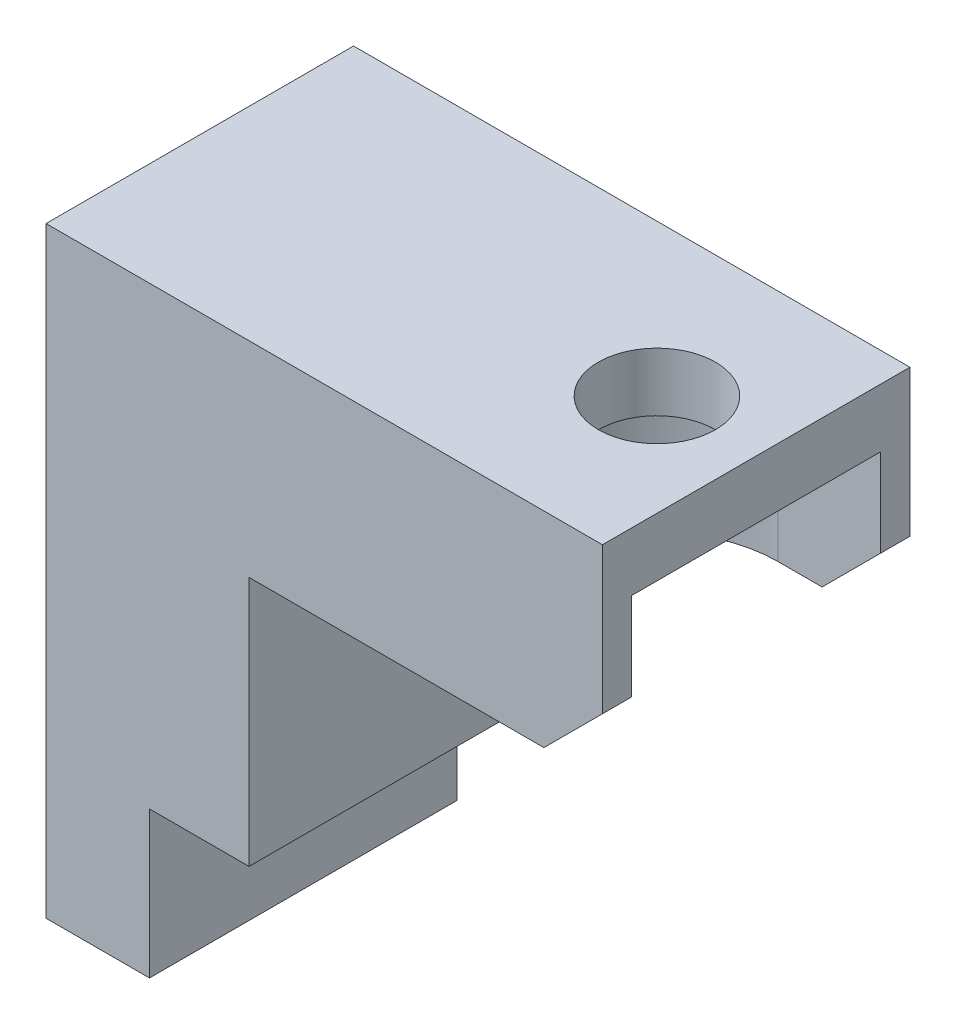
from build123d import *

# Parameters (mm, degrees)
EXTRUSION1_DEPTH        = 5.25
EXTRUSION2_DEPTH        = 5
ESQUISSE3_R             = 2
ENL_V_MAT_EXTRU_1_DEPTH = 2
CHANFREIN1_SIZE         = 2


with BuildPart() as part:
    # Esquisse1 → Extrusion1 (new, symmetric)
    with BuildSketch(Plane.XY):
        Polygon((-55.719296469, 49), (-67.787598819, 49), (-67.787598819, 35.452607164), (-71.187598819, 35.452607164), (-71.187598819, 30.452607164), (-74.719296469, 30.452607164), (-74.719296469, 51), (-55.719296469, 51), align=None)
    extrude(amount=EXTRUSION1_DEPTH, both=True)

    # Esquisse2 → Extrusion2 (add)
    with BuildSketch(Plane.XZ.offset(-49)):
        with BuildLine():
            Line((-55.719296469, 5.25), (-69.802319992, 5.25))
            Line((-69.802319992, 5.25), (-69.802319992, -5.25))
            Line((-69.802319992, -5.25), (-55.719296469, -5.25))
            Line((-55.719296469, -5.25), (-55.719296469, -4.25))
            Line((-55.719296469, -4.25), (-59.219296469, -4.25))
            ThreePointArc((-59.219296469, -4.25), (-63.469296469, 0), (-59.219296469, 4.25))
            Line((-59.219296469, 4.25), (-55.719296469, 4.25))
            Line((-55.719296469, 4.25), (-55.719296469, 5.25))
        make_face()
    extrude(amount=EXTRUSION2_DEPTH)

    # Esquisse3 → Enl_v. mat.-Extru.1 (cut)
    with BuildSketch(Plane(origin=(0, 51, 0), x_dir=(-1, 0, 0), z_dir=(0, 1, 0))):
        with Locations(Location((59.190865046, -0.081564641, 0), (0, 0, 90))):
            Circle(ESQUISSE3_R)
    extrude(amount=-ENL_V_MAT_EXTRU_1_DEPTH, mode=Mode.SUBTRACT)

    # Chanfrein1
    chanfrein1_edges = [part.edges().sort_by_distance(p)[0] for p in [
        (-55.719296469, 44, -4.75),
        (-55.719296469, 44, 4.75),
    ]]
    chamfer(chanfrein1_edges, length=CHANFREIN1_SIZE)


solid = part.part
